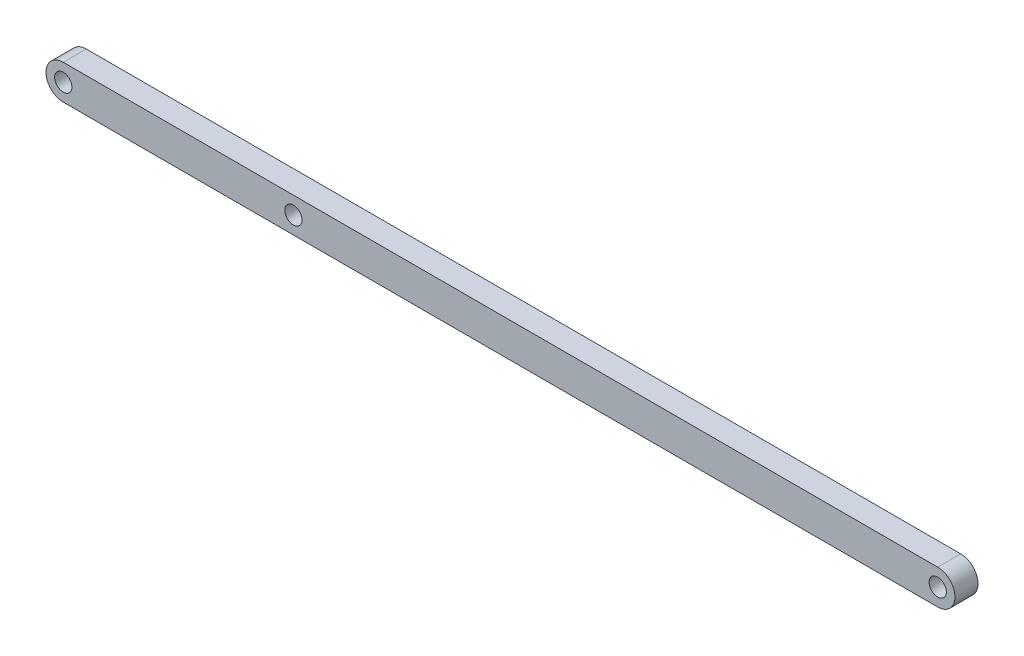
ISO-10303-21;
HEADER;
FILE_DESCRIPTION(('STEP AP214'),'2;1');
FILE_NAME('part.step','',(''),(''),'','','');
FILE_SCHEMA(('AUTOMOTIVE_DESIGN { 1 0 10303 214 1 1 1 1 }'));
ENDSEC;
DATA;
#1=APPLICATION_CONTEXT('core data for automotive mechanical design processes');
#2=APPLICATION_PROTOCOL_DEFINITION('international standard','automotive_design',2000,#1);
#3=PRODUCT_CONTEXT('',#1,'mechanical');
#4=PRODUCT('Part','Part','',(#3));
#5=PRODUCT_RELATED_PRODUCT_CATEGORY('part','',(#4));
#6=PRODUCT_DEFINITION_FORMATION('','',#4);
#7=PRODUCT_DEFINITION_CONTEXT('part definition',#1,'design');
#8=PRODUCT_DEFINITION('design','',#6,#7);
#9=PRODUCT_DEFINITION_SHAPE('','',#8);
#10=(LENGTH_UNIT() NAMED_UNIT(*) SI_UNIT(.MILLI.,.METRE.));
#11=(NAMED_UNIT(*) PLANE_ANGLE_UNIT() SI_UNIT($,.RADIAN.));
#12=(NAMED_UNIT(*) SI_UNIT($,.STERADIAN.) SOLID_ANGLE_UNIT());
#13=UNCERTAINTY_MEASURE_WITH_UNIT(LENGTH_MEASURE(1.E-05),#10,'distance_accuracy_value','');
#14=(GEOMETRIC_REPRESENTATION_CONTEXT(3) GLOBAL_UNCERTAINTY_ASSIGNED_CONTEXT((#13)) GLOBAL_UNIT_ASSIGNED_CONTEXT((#10,
#11,#12)) REPRESENTATION_CONTEXT('',''));
#15=CARTESIAN_POINT('',(0.,0.,0.));
#16=DIRECTION('',(0.,0.,1.));
#17=DIRECTION('',(1.,0.,0.));
#18=AXIS2_PLACEMENT_3D('',#15,#16,#17);
#19=CARTESIAN_POINT('',(0.,0.,2.));
#20=DIRECTION('',(0.,0.,1.));
#21=DIRECTION('',(1.,0.,0.));
#22=AXIS2_PLACEMENT_3D('',#19,#20,#21);
#23=PLANE('',#22);
#24=CARTESIAN_POINT('',(20.,0.,2.));
#25=DIRECTION('',(0.,0.,1.));
#26=DIRECTION('',(1.,0.,0.));
#27=AXIS2_PLACEMENT_3D('',#24,#25,#26);
#28=CIRCLE('',#27,0.749999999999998);
#29=CARTESIAN_POINT('',(20.75,0.,2.));
#30=VERTEX_POINT('',#29);
#31=EDGE_CURVE('E129',#30,#30,#28,.T.);
#32=ORIENTED_EDGE('',*,*,#31,.F.);
#33=EDGE_LOOP('',(#32));
#34=FACE_BOUND('',#33,.T.);
#35=CARTESIAN_POINT('',(0.,0.,2.));
#36=DIRECTION('',(0.,0.,1.));
#37=DIRECTION('',(1.,0.,0.));
#38=AXIS2_PLACEMENT_3D('',#35,#36,#37);
#39=CIRCLE('',#38,0.75);
#40=CARTESIAN_POINT('',(0.75,0.,2.));
#41=VERTEX_POINT('',#40);
#42=EDGE_CURVE('E90',#41,#41,#39,.T.);
#43=ORIENTED_EDGE('',*,*,#42,.F.);
#44=EDGE_LOOP('',(#43));
#45=FACE_BOUND('',#44,.T.);
#46=CARTESIAN_POINT('',(0.,0.,2.));
#47=DIRECTION('',(0.,0.,1.));
#48=DIRECTION('',(1.,0.,0.));
#49=AXIS2_PLACEMENT_3D('',#46,#47,#48);
#50=CIRCLE('',#49,1.5);
#51=CARTESIAN_POINT('',(0.,1.5,2.));
#52=VERTEX_POINT('',#51);
#53=CARTESIAN_POINT('',(0.,-1.5,2.));
#54=VERTEX_POINT('',#53);
#55=EDGE_CURVE('E100',#52,#54,#50,.T.);
#56=ORIENTED_EDGE('',*,*,#55,.T.);
#57=DIRECTION('',(1.,0.,0.));
#58=VECTOR('',#57,1.);
#59=CARTESIAN_POINT('',(0.,-1.5,2.));
#60=LINE('',#59,#58);
#61=CARTESIAN_POINT('',(76.0000000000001,-1.5,2.));
#62=VERTEX_POINT('',#61);
#63=EDGE_CURVE('E85',#54,#62,#60,.T.);
#64=ORIENTED_EDGE('',*,*,#63,.T.);
#65=CARTESIAN_POINT('',(76.0000000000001,0.,2.));
#66=DIRECTION('',(0.,0.,1.));
#67=DIRECTION('',(1.,0.,0.));
#68=AXIS2_PLACEMENT_3D('',#65,#66,#67);
#69=CIRCLE('',#68,1.5);
#70=CARTESIAN_POINT('',(76.,1.5,2.));
#71=VERTEX_POINT('',#70);
#72=EDGE_CURVE('E51',#62,#71,#69,.T.);
#73=ORIENTED_EDGE('',*,*,#72,.T.);
#74=DIRECTION('',(-1.,0.,0.));
#75=VECTOR('',#74,1.);
#76=CARTESIAN_POINT('',(0.,1.5,2.));
#77=LINE('',#76,#75);
#78=EDGE_CURVE('E46',#71,#52,#77,.T.);
#79=ORIENTED_EDGE('',*,*,#78,.T.);
#80=EDGE_LOOP('',(#56,#64,#73,#79));
#81=FACE_BOUND('',#80,.T.);
#82=CARTESIAN_POINT('',(76.0000000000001,0.,2.));
#83=DIRECTION('',(0.,0.,1.));
#84=DIRECTION('',(1.,0.,0.));
#85=AXIS2_PLACEMENT_3D('',#82,#83,#84);
#86=CIRCLE('',#85,0.749999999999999);
#87=CARTESIAN_POINT('',(76.7500000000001,0.,2.));
#88=VERTEX_POINT('',#87);
#89=EDGE_CURVE('E118',#88,#88,#86,.T.);
#90=ORIENTED_EDGE('',*,*,#89,.F.);
#91=EDGE_LOOP('',(#90));
#92=FACE_BOUND('',#91,.T.);
#93=ADVANCED_FACE('F31',(#34,#45,#81,#92),#23,.T.);
#94=CARTESIAN_POINT('',(0.,0.,0.));
#95=DIRECTION('',(0.,0.,1.));
#96=DIRECTION('',(1.,0.,0.));
#97=AXIS2_PLACEMENT_3D('',#94,#95,#96);
#98=PLANE('',#97);
#99=CARTESIAN_POINT('',(20.,0.,0.));
#100=DIRECTION('',(0.,0.,1.));
#101=DIRECTION('',(1.,0.,0.));
#102=AXIS2_PLACEMENT_3D('',#99,#100,#101);
#103=CIRCLE('',#102,0.749999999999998);
#104=CARTESIAN_POINT('',(20.75,0.,0.));
#105=VERTEX_POINT('',#104);
#106=EDGE_CURVE('E124',#105,#105,#103,.T.);
#107=ORIENTED_EDGE('',*,*,#106,.T.);
#108=EDGE_LOOP('',(#107));
#109=FACE_BOUND('',#108,.T.);
#110=CARTESIAN_POINT('',(0.,0.,0.));
#111=DIRECTION('',(0.,0.,1.));
#112=DIRECTION('',(1.,0.,0.));
#113=AXIS2_PLACEMENT_3D('',#110,#111,#112);
#114=CIRCLE('',#113,0.75);
#115=CARTESIAN_POINT('',(0.75,0.,0.));
#116=VERTEX_POINT('',#115);
#117=EDGE_CURVE('E93',#116,#116,#114,.T.);
#118=ORIENTED_EDGE('',*,*,#117,.T.);
#119=EDGE_LOOP('',(#118));
#120=FACE_BOUND('',#119,.T.);
#121=CARTESIAN_POINT('',(0.,0.,0.));
#122=DIRECTION('',(0.,0.,1.));
#123=DIRECTION('',(1.,0.,0.));
#124=AXIS2_PLACEMENT_3D('',#121,#122,#123);
#125=CIRCLE('',#124,1.5);
#126=CARTESIAN_POINT('',(0.,1.5,0.));
#127=VERTEX_POINT('',#126);
#128=CARTESIAN_POINT('',(0.,-1.5,0.));
#129=VERTEX_POINT('',#128);
#130=EDGE_CURVE('E77',#127,#129,#125,.T.);
#131=ORIENTED_EDGE('',*,*,#130,.F.);
#132=DIRECTION('',(-1.,0.,0.));
#133=VECTOR('',#132,1.);
#134=CARTESIAN_POINT('',(0.,1.5,0.));
#135=LINE('',#134,#133);
#136=CARTESIAN_POINT('',(76.,1.5,0.));
#137=VERTEX_POINT('',#136);
#138=EDGE_CURVE('E98',#137,#127,#135,.T.);
#139=ORIENTED_EDGE('',*,*,#138,.F.);
#140=CARTESIAN_POINT('',(76.0000000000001,0.,0.));
#141=DIRECTION('',(0.,0.,1.));
#142=DIRECTION('',(1.,0.,0.));
#143=AXIS2_PLACEMENT_3D('',#140,#141,#142);
#144=CIRCLE('',#143,1.5);
#145=CARTESIAN_POINT('',(76.0000000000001,-1.5,0.));
#146=VERTEX_POINT('',#145);
#147=EDGE_CURVE('E78',#146,#137,#144,.T.);
#148=ORIENTED_EDGE('',*,*,#147,.F.);
#149=DIRECTION('',(1.,0.,0.));
#150=VECTOR('',#149,1.);
#151=CARTESIAN_POINT('',(0.,-1.5,0.));
#152=LINE('',#151,#150);
#153=EDGE_CURVE('E72',#129,#146,#152,.T.);
#154=ORIENTED_EDGE('',*,*,#153,.F.);
#155=EDGE_LOOP('',(#131,#139,#148,#154));
#156=FACE_BOUND('',#155,.T.);
#157=CARTESIAN_POINT('',(76.0000000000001,0.,0.));
#158=DIRECTION('',(0.,0.,1.));
#159=DIRECTION('',(1.,0.,0.));
#160=AXIS2_PLACEMENT_3D('',#157,#158,#159);
#161=CIRCLE('',#160,0.749999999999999);
#162=CARTESIAN_POINT('',(76.7500000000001,0.,0.));
#163=VERTEX_POINT('',#162);
#164=EDGE_CURVE('E120',#163,#163,#161,.T.);
#165=ORIENTED_EDGE('',*,*,#164,.T.);
#166=EDGE_LOOP('',(#165));
#167=FACE_BOUND('',#166,.T.);
#168=ADVANCED_FACE('F73',(#109,#120,#156,#167),#98,.F.);
#169=CARTESIAN_POINT('',(0.,0.,2.));
#170=DIRECTION('',(0.,0.,-1.));
#171=DIRECTION('',(-1.,0.,0.));
#172=AXIS2_PLACEMENT_3D('',#169,#170,#171);
#173=CYLINDRICAL_SURFACE('',#172,1.5);
#174=ORIENTED_EDGE('',*,*,#130,.T.);
#175=DIRECTION('',(0.,0.,-1.));
#176=VECTOR('',#175,1.);
#177=CARTESIAN_POINT('',(0.,-1.5,2.));
#178=LINE('',#177,#176);
#179=EDGE_CURVE('E11',#54,#129,#178,.T.);
#180=ORIENTED_EDGE('',*,*,#179,.F.);
#181=ORIENTED_EDGE('',*,*,#55,.F.);
#182=DIRECTION('',(0.,0.,-1.));
#183=VECTOR('',#182,1.);
#184=CARTESIAN_POINT('',(0.,1.5,2.));
#185=LINE('',#184,#183);
#186=EDGE_CURVE('E89',#52,#127,#185,.T.);
#187=ORIENTED_EDGE('',*,*,#186,.T.);
#188=EDGE_LOOP('',(#174,#180,#181,#187));
#189=FACE_BOUND('',#188,.T.);
#190=ADVANCED_FACE('F33',(#189),#173,.T.);
#191=CARTESIAN_POINT('',(0.,-1.5,2.));
#192=DIRECTION('',(0.,1.,0.));
#193=DIRECTION('',(0.,0.,1.));
#194=AXIS2_PLACEMENT_3D('',#191,#192,#193);
#195=PLANE('',#194);
#196=ORIENTED_EDGE('',*,*,#153,.T.);
#197=DIRECTION('',(0.,0.,-1.));
#198=VECTOR('',#197,1.);
#199=CARTESIAN_POINT('',(76.0000000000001,-1.5,2.));
#200=LINE('',#199,#198);
#201=EDGE_CURVE('E39',#62,#146,#200,.T.);
#202=ORIENTED_EDGE('',*,*,#201,.F.);
#203=ORIENTED_EDGE('',*,*,#63,.F.);
#204=ORIENTED_EDGE('',*,*,#179,.T.);
#205=EDGE_LOOP('',(#196,#202,#203,#204));
#206=FACE_BOUND('',#205,.T.);
#207=ADVANCED_FACE('F84',(#206),#195,.F.);
#208=CARTESIAN_POINT('',(76.0000000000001,0.,2.));
#209=DIRECTION('',(0.,0.,-1.));
#210=DIRECTION('',(-1.,0.,0.));
#211=AXIS2_PLACEMENT_3D('',#208,#209,#210);
#212=CYLINDRICAL_SURFACE('',#211,1.5);
#213=ORIENTED_EDGE('',*,*,#147,.T.);
#214=DIRECTION('',(0.,0.,-1.));
#215=VECTOR('',#214,1.);
#216=CARTESIAN_POINT('',(76.,1.5,2.));
#217=LINE('',#216,#215);
#218=EDGE_CURVE('E106',#71,#137,#217,.T.);
#219=ORIENTED_EDGE('',*,*,#218,.F.);
#220=ORIENTED_EDGE('',*,*,#72,.F.);
#221=ORIENTED_EDGE('',*,*,#201,.T.);
#222=EDGE_LOOP('',(#213,#219,#220,#221));
#223=FACE_BOUND('',#222,.T.);
#224=ADVANCED_FACE('F109',(#223),#212,.T.);
#225=CARTESIAN_POINT('',(0.,1.5,2.));
#226=DIRECTION('',(0.,-1.,0.));
#227=DIRECTION('',(0.,0.,-1.));
#228=AXIS2_PLACEMENT_3D('',#225,#226,#227);
#229=PLANE('',#228);
#230=ORIENTED_EDGE('',*,*,#138,.T.);
#231=ORIENTED_EDGE('',*,*,#186,.F.);
#232=ORIENTED_EDGE('',*,*,#78,.F.);
#233=ORIENTED_EDGE('',*,*,#218,.T.);
#234=EDGE_LOOP('',(#230,#231,#232,#233));
#235=FACE_BOUND('',#234,.T.);
#236=ADVANCED_FACE('F111',(#235),#229,.F.);
#237=CARTESIAN_POINT('',(0.,0.,2.));
#238=DIRECTION('',(0.,0.,-1.));
#239=DIRECTION('',(-1.,0.,0.));
#240=AXIS2_PLACEMENT_3D('',#237,#238,#239);
#241=CYLINDRICAL_SURFACE('',#240,0.75);
#242=ORIENTED_EDGE('',*,*,#42,.T.);
#243=EDGE_LOOP('',(#242));
#244=FACE_BOUND('',#243,.T.);
#245=ORIENTED_EDGE('',*,*,#117,.F.);
#246=EDGE_LOOP('',(#245));
#247=FACE_BOUND('',#246,.T.);
#248=ADVANCED_FACE('F137',(#244,#247),#241,.F.);
#249=CARTESIAN_POINT('',(76.0000000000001,0.,2.));
#250=DIRECTION('',(0.,0.,-1.));
#251=DIRECTION('',(-1.,0.,0.));
#252=AXIS2_PLACEMENT_3D('',#249,#250,#251);
#253=CYLINDRICAL_SURFACE('',#252,0.749999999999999);
#254=ORIENTED_EDGE('',*,*,#89,.T.);
#255=EDGE_LOOP('',(#254));
#256=FACE_BOUND('',#255,.T.);
#257=ORIENTED_EDGE('',*,*,#164,.F.);
#258=EDGE_LOOP('',(#257));
#259=FACE_BOUND('',#258,.T.);
#260=ADVANCED_FACE('F140',(#256,#259),#253,.F.);
#261=CARTESIAN_POINT('',(20.,0.,0.));
#262=DIRECTION('',(0.,0.,1.));
#263=DIRECTION('',(1.,0.,0.));
#264=AXIS2_PLACEMENT_3D('',#261,#262,#263);
#265=CYLINDRICAL_SURFACE('',#264,0.749999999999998);
#266=ORIENTED_EDGE('',*,*,#106,.F.);
#267=EDGE_LOOP('',(#266));
#268=FACE_BOUND('',#267,.T.);
#269=ORIENTED_EDGE('',*,*,#31,.T.);
#270=EDGE_LOOP('',(#269));
#271=FACE_BOUND('',#270,.T.);
#272=ADVANCED_FACE('F133',(#268,#271),#265,.F.);
#273=CLOSED_SHELL('',(#93,#168,#190,#207,#224,#236,#248,#260,#272));
#274=MANIFOLD_SOLID_BREP('B2',#273);
#275=ADVANCED_BREP_SHAPE_REPRESENTATION('',(#18,#274),#14);
#276=SHAPE_DEFINITION_REPRESENTATION(#9,#275);
ENDSEC;
END-ISO-10303-21;
